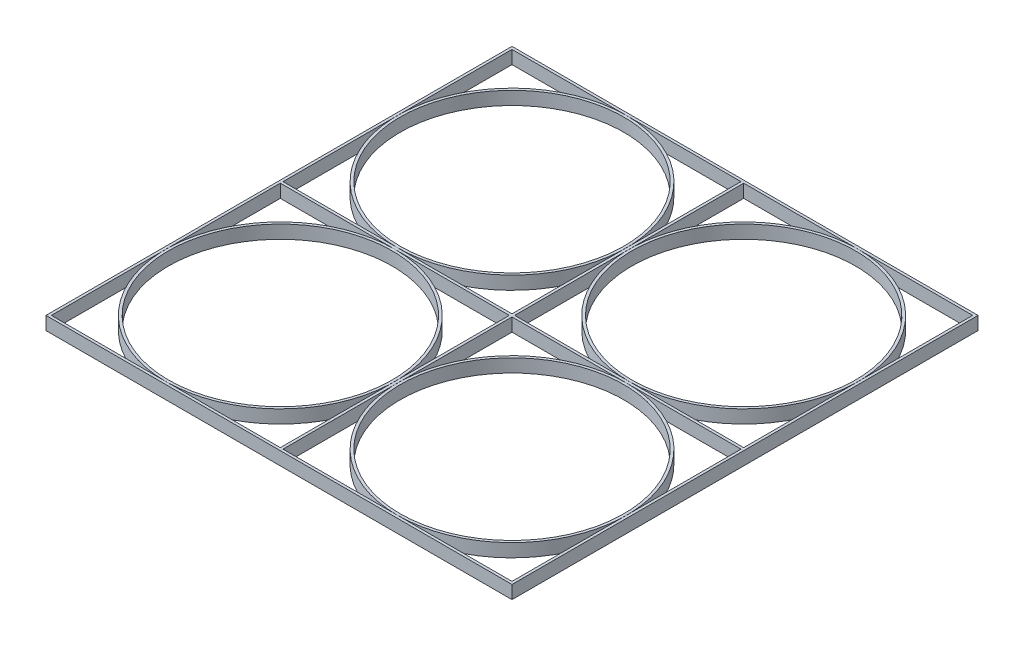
ISO-10303-21;
HEADER;
FILE_DESCRIPTION(('STEP AP214'),'2;1');
FILE_NAME('part.step','',(''),(''),'','','');
FILE_SCHEMA(('AUTOMOTIVE_DESIGN { 1 0 10303 214 1 1 1 1 }'));
ENDSEC;
DATA;
#1=APPLICATION_CONTEXT('core data for automotive mechanical design processes');
#2=APPLICATION_PROTOCOL_DEFINITION('international standard','automotive_design',2000,#1);
#3=PRODUCT_CONTEXT('',#1,'mechanical');
#4=PRODUCT('Part','Part','',(#3));
#5=PRODUCT_RELATED_PRODUCT_CATEGORY('part','',(#4));
#6=PRODUCT_DEFINITION_FORMATION('','',#4);
#7=PRODUCT_DEFINITION_CONTEXT('part definition',#1,'design');
#8=PRODUCT_DEFINITION('design','',#6,#7);
#9=PRODUCT_DEFINITION_SHAPE('','',#8);
#10=(LENGTH_UNIT() NAMED_UNIT(*) SI_UNIT(.MILLI.,.METRE.));
#11=(NAMED_UNIT(*) PLANE_ANGLE_UNIT() SI_UNIT($,.RADIAN.));
#12=(NAMED_UNIT(*) SI_UNIT($,.STERADIAN.) SOLID_ANGLE_UNIT());
#13=UNCERTAINTY_MEASURE_WITH_UNIT(LENGTH_MEASURE(1.E-05),#10,'distance_accuracy_value','');
#14=(GEOMETRIC_REPRESENTATION_CONTEXT(3) GLOBAL_UNCERTAINTY_ASSIGNED_CONTEXT((#13)) GLOBAL_UNIT_ASSIGNED_CONTEXT((#10,
#11,#12)) REPRESENTATION_CONTEXT('',''));
#15=CARTESIAN_POINT('',(0.,0.,0.));
#16=DIRECTION('',(0.,0.,1.));
#17=DIRECTION('',(1.,0.,0.));
#18=AXIS2_PLACEMENT_3D('',#15,#16,#17);
#19=CARTESIAN_POINT('',(87.75,5.,87.75));
#20=DIRECTION('',(0.,1.,0.));
#21=DIRECTION('',(0.,0.,1.));
#22=AXIS2_PLACEMENT_3D('',#19,#20,#21);
#23=PLANE('',#22);
#24=CARTESIAN_POINT('',(87.75,5.,87.75));
#25=DIRECTION('',(0.,1.,0.));
#26=DIRECTION('',(0.,0.,1.));
#27=AXIS2_PLACEMENT_3D('',#24,#25,#26);
#28=CIRCLE('',#27,43.375);
#29=CARTESIAN_POINT('',(87.75,5.,131.125));
#30=VERTEX_POINT('',#29);
#31=EDGE_CURVE('E12',#30,#30,#28,.T.);
#32=ORIENTED_EDGE('',*,*,#31,.T.);
#33=EDGE_LOOP('',(#32));
#34=FACE_BOUND('',#33,.T.);
#35=CARTESIAN_POINT('',(87.75,5.,87.75));
#36=DIRECTION('',(0.,1.,0.));
#37=DIRECTION('',(0.,0.,1.));
#38=AXIS2_PLACEMENT_3D('',#35,#36,#37);
#39=CIRCLE('',#38,42.375);
#40=CARTESIAN_POINT('',(87.75,5.,130.125));
#41=VERTEX_POINT('',#40);
#42=EDGE_CURVE('E79',#41,#41,#39,.T.);
#43=ORIENTED_EDGE('',*,*,#42,.F.);
#44=EDGE_LOOP('',(#43));
#45=FACE_BOUND('',#44,.T.);
#46=ADVANCED_FACE('F68',(#34,#45),#23,.T.);
#47=CARTESIAN_POINT('',(87.75,0.,87.75));
#48=DIRECTION('',(0.,1.,0.));
#49=DIRECTION('',(0.,0.,1.));
#50=AXIS2_PLACEMENT_3D('',#47,#48,#49);
#51=PLANE('',#50);
#52=CARTESIAN_POINT('',(87.75,0.,87.75));
#53=DIRECTION('',(0.,1.,0.));
#54=DIRECTION('',(0.,0.,1.));
#55=AXIS2_PLACEMENT_3D('',#52,#53,#54);
#56=CIRCLE('',#55,43.375);
#57=CARTESIAN_POINT('',(87.75,0.,131.125));
#58=VERTEX_POINT('',#57);
#59=EDGE_CURVE('E72',#58,#58,#56,.T.);
#60=ORIENTED_EDGE('',*,*,#59,.F.);
#61=EDGE_LOOP('',(#60));
#62=FACE_BOUND('',#61,.T.);
#63=CARTESIAN_POINT('',(87.75,0.,87.75));
#64=DIRECTION('',(0.,1.,0.));
#65=DIRECTION('',(0.,0.,1.));
#66=AXIS2_PLACEMENT_3D('',#63,#64,#65);
#67=CIRCLE('',#66,42.375);
#68=CARTESIAN_POINT('',(87.75,0.,130.125));
#69=VERTEX_POINT('',#68);
#70=EDGE_CURVE('E81',#69,#69,#67,.T.);
#71=ORIENTED_EDGE('',*,*,#70,.T.);
#72=EDGE_LOOP('',(#71));
#73=FACE_BOUND('',#72,.T.);
#74=ADVANCED_FACE('F91',(#62,#73),#51,.F.);
#75=CARTESIAN_POINT('',(87.75,5.,87.75));
#76=DIRECTION('',(0.,-1.,0.));
#77=DIRECTION('',(0.,0.,-1.));
#78=AXIS2_PLACEMENT_3D('',#75,#76,#77);
#79=CYLINDRICAL_SURFACE('',#78,43.375);
#80=ORIENTED_EDGE('',*,*,#31,.F.);
#81=EDGE_LOOP('',(#80));
#82=FACE_BOUND('',#81,.T.);
#83=ORIENTED_EDGE('',*,*,#59,.T.);
#84=EDGE_LOOP('',(#83));
#85=FACE_BOUND('',#84,.T.);
#86=ADVANCED_FACE('F70',(#82,#85),#79,.T.);
#87=CARTESIAN_POINT('',(87.75,5.,87.75));
#88=DIRECTION('',(0.,-1.,0.));
#89=DIRECTION('',(0.,0.,-1.));
#90=AXIS2_PLACEMENT_3D('',#87,#88,#89);
#91=CYLINDRICAL_SURFACE('',#90,42.375);
#92=ORIENTED_EDGE('',*,*,#42,.T.);
#93=EDGE_LOOP('',(#92));
#94=FACE_BOUND('',#93,.T.);
#95=ORIENTED_EDGE('',*,*,#70,.F.);
#96=EDGE_LOOP('',(#95));
#97=FACE_BOUND('',#96,.T.);
#98=ADVANCED_FACE('F87',(#94,#97),#91,.F.);
#99=CLOSED_SHELL('',(#46,#74,#86,#98));
#100=MANIFOLD_SOLID_BREP('B2',#99);
#101=CARTESIAN_POINT('',(0.,5.,87.75));
#102=DIRECTION('',(0.,1.,0.));
#103=DIRECTION('',(0.,0.,1.));
#104=AXIS2_PLACEMENT_3D('',#101,#102,#103);
#105=PLANE('',#104);
#106=CARTESIAN_POINT('',(0.,5.,87.75));
#107=DIRECTION('',(0.,1.,0.));
#108=DIRECTION('',(0.,0.,1.));
#109=AXIS2_PLACEMENT_3D('',#106,#107,#108);
#110=CIRCLE('',#109,43.375);
#111=CARTESIAN_POINT('',(0.,5.,131.125));
#112=VERTEX_POINT('',#111);
#113=EDGE_CURVE('E67',#112,#112,#110,.T.);
#114=ORIENTED_EDGE('',*,*,#113,.T.);
#115=EDGE_LOOP('',(#114));
#116=FACE_BOUND('',#115,.T.);
#117=CARTESIAN_POINT('',(0.,5.,87.75));
#118=DIRECTION('',(0.,1.,0.));
#119=DIRECTION('',(0.,0.,1.));
#120=AXIS2_PLACEMENT_3D('',#117,#118,#119);
#121=CIRCLE('',#120,42.375);
#122=CARTESIAN_POINT('',(0.,5.,130.125));
#123=VERTEX_POINT('',#122);
#124=EDGE_CURVE('E149',#123,#123,#121,.T.);
#125=ORIENTED_EDGE('',*,*,#124,.F.);
#126=EDGE_LOOP('',(#125));
#127=FACE_BOUND('',#126,.T.);
#128=ADVANCED_FACE('F138',(#116,#127),#105,.T.);
#129=CARTESIAN_POINT('',(0.,0.,87.75));
#130=DIRECTION('',(0.,1.,0.));
#131=DIRECTION('',(0.,0.,1.));
#132=AXIS2_PLACEMENT_3D('',#129,#130,#131);
#133=PLANE('',#132);
#134=CARTESIAN_POINT('',(0.,0.,87.75));
#135=DIRECTION('',(0.,1.,0.));
#136=DIRECTION('',(0.,0.,1.));
#137=AXIS2_PLACEMENT_3D('',#134,#135,#136);
#138=CIRCLE('',#137,43.375);
#139=CARTESIAN_POINT('',(0.,0.,131.125));
#140=VERTEX_POINT('',#139);
#141=EDGE_CURVE('E142',#140,#140,#138,.T.);
#142=ORIENTED_EDGE('',*,*,#141,.F.);
#143=EDGE_LOOP('',(#142));
#144=FACE_BOUND('',#143,.T.);
#145=CARTESIAN_POINT('',(0.,0.,87.75));
#146=DIRECTION('',(0.,1.,0.));
#147=DIRECTION('',(0.,0.,1.));
#148=AXIS2_PLACEMENT_3D('',#145,#146,#147);
#149=CIRCLE('',#148,42.375);
#150=CARTESIAN_POINT('',(0.,0.,130.125));
#151=VERTEX_POINT('',#150);
#152=EDGE_CURVE('E151',#151,#151,#149,.T.);
#153=ORIENTED_EDGE('',*,*,#152,.T.);
#154=EDGE_LOOP('',(#153));
#155=FACE_BOUND('',#154,.T.);
#156=ADVANCED_FACE('F161',(#144,#155),#133,.F.);
#157=CARTESIAN_POINT('',(0.,5.,87.75));
#158=DIRECTION('',(0.,-1.,0.));
#159=DIRECTION('',(0.,0.,-1.));
#160=AXIS2_PLACEMENT_3D('',#157,#158,#159);
#161=CYLINDRICAL_SURFACE('',#160,43.375);
#162=ORIENTED_EDGE('',*,*,#113,.F.);
#163=EDGE_LOOP('',(#162));
#164=FACE_BOUND('',#163,.T.);
#165=ORIENTED_EDGE('',*,*,#141,.T.);
#166=EDGE_LOOP('',(#165));
#167=FACE_BOUND('',#166,.T.);
#168=ADVANCED_FACE('F140',(#164,#167),#161,.T.);
#169=CARTESIAN_POINT('',(0.,5.,87.75));
#170=DIRECTION('',(0.,-1.,0.));
#171=DIRECTION('',(0.,0.,-1.));
#172=AXIS2_PLACEMENT_3D('',#169,#170,#171);
#173=CYLINDRICAL_SURFACE('',#172,42.375);
#174=ORIENTED_EDGE('',*,*,#124,.T.);
#175=EDGE_LOOP('',(#174));
#176=FACE_BOUND('',#175,.T.);
#177=ORIENTED_EDGE('',*,*,#152,.F.);
#178=EDGE_LOOP('',(#177));
#179=FACE_BOUND('',#178,.T.);
#180=ADVANCED_FACE('F157',(#176,#179),#173,.F.);
#181=CLOSED_SHELL('',(#128,#156,#168,#180));
#182=MANIFOLD_SOLID_BREP('B7',#181);
#183=CARTESIAN_POINT('',(87.75,5.,0.));
#184=DIRECTION('',(0.,1.,0.));
#185=DIRECTION('',(0.,0.,1.));
#186=AXIS2_PLACEMENT_3D('',#183,#184,#185);
#187=PLANE('',#186);
#188=CARTESIAN_POINT('',(87.75,5.,0.));
#189=DIRECTION('',(0.,1.,0.));
#190=DIRECTION('',(0.,0.,1.));
#191=AXIS2_PLACEMENT_3D('',#188,#189,#190);
#192=CIRCLE('',#191,43.375);
#193=CARTESIAN_POINT('',(87.75,5.,43.375));
#194=VERTEX_POINT('',#193);
#195=EDGE_CURVE('E137',#194,#194,#192,.T.);
#196=ORIENTED_EDGE('',*,*,#195,.T.);
#197=EDGE_LOOP('',(#196));
#198=FACE_BOUND('',#197,.T.);
#199=CARTESIAN_POINT('',(87.75,5.,0.));
#200=DIRECTION('',(0.,1.,0.));
#201=DIRECTION('',(0.,0.,1.));
#202=AXIS2_PLACEMENT_3D('',#199,#200,#201);
#203=CIRCLE('',#202,42.375);
#204=CARTESIAN_POINT('',(87.75,5.,42.375));
#205=VERTEX_POINT('',#204);
#206=EDGE_CURVE('E219',#205,#205,#203,.T.);
#207=ORIENTED_EDGE('',*,*,#206,.F.);
#208=EDGE_LOOP('',(#207));
#209=FACE_BOUND('',#208,.T.);
#210=ADVANCED_FACE('F208',(#198,#209),#187,.T.);
#211=CARTESIAN_POINT('',(87.75,0.,0.));
#212=DIRECTION('',(0.,1.,0.));
#213=DIRECTION('',(0.,0.,1.));
#214=AXIS2_PLACEMENT_3D('',#211,#212,#213);
#215=PLANE('',#214);
#216=CARTESIAN_POINT('',(87.75,0.,0.));
#217=DIRECTION('',(0.,1.,0.));
#218=DIRECTION('',(0.,0.,1.));
#219=AXIS2_PLACEMENT_3D('',#216,#217,#218);
#220=CIRCLE('',#219,43.375);
#221=CARTESIAN_POINT('',(87.75,0.,43.375));
#222=VERTEX_POINT('',#221);
#223=EDGE_CURVE('E212',#222,#222,#220,.T.);
#224=ORIENTED_EDGE('',*,*,#223,.F.);
#225=EDGE_LOOP('',(#224));
#226=FACE_BOUND('',#225,.T.);
#227=CARTESIAN_POINT('',(87.75,0.,0.));
#228=DIRECTION('',(0.,1.,0.));
#229=DIRECTION('',(0.,0.,1.));
#230=AXIS2_PLACEMENT_3D('',#227,#228,#229);
#231=CIRCLE('',#230,42.375);
#232=CARTESIAN_POINT('',(87.75,0.,42.375));
#233=VERTEX_POINT('',#232);
#234=EDGE_CURVE('E221',#233,#233,#231,.T.);
#235=ORIENTED_EDGE('',*,*,#234,.T.);
#236=EDGE_LOOP('',(#235));
#237=FACE_BOUND('',#236,.T.);
#238=ADVANCED_FACE('F231',(#226,#237),#215,.F.);
#239=CARTESIAN_POINT('',(87.75,5.,0.));
#240=DIRECTION('',(0.,-1.,0.));
#241=DIRECTION('',(0.,0.,-1.));
#242=AXIS2_PLACEMENT_3D('',#239,#240,#241);
#243=CYLINDRICAL_SURFACE('',#242,43.375);
#244=ORIENTED_EDGE('',*,*,#195,.F.);
#245=EDGE_LOOP('',(#244));
#246=FACE_BOUND('',#245,.T.);
#247=ORIENTED_EDGE('',*,*,#223,.T.);
#248=EDGE_LOOP('',(#247));
#249=FACE_BOUND('',#248,.T.);
#250=ADVANCED_FACE('F210',(#246,#249),#243,.T.);
#251=CARTESIAN_POINT('',(87.75,5.,0.));
#252=DIRECTION('',(0.,-1.,0.));
#253=DIRECTION('',(0.,0.,-1.));
#254=AXIS2_PLACEMENT_3D('',#251,#252,#253);
#255=CYLINDRICAL_SURFACE('',#254,42.375);
#256=ORIENTED_EDGE('',*,*,#206,.T.);
#257=EDGE_LOOP('',(#256));
#258=FACE_BOUND('',#257,.T.);
#259=ORIENTED_EDGE('',*,*,#234,.F.);
#260=EDGE_LOOP('',(#259));
#261=FACE_BOUND('',#260,.T.);
#262=ADVANCED_FACE('F227',(#258,#261),#255,.F.);
#263=CLOSED_SHELL('',(#210,#238,#250,#262));
#264=MANIFOLD_SOLID_BREP('B62',#263);
#265=CARTESIAN_POINT('',(0.,5.,0.));
#266=DIRECTION('',(0.,1.,0.));
#267=DIRECTION('',(0.,0.,1.));
#268=AXIS2_PLACEMENT_3D('',#265,#266,#267);
#269=PLANE('',#268);
#270=CARTESIAN_POINT('',(0.,5.,0.));
#271=DIRECTION('',(0.,1.,0.));
#272=DIRECTION('',(0.,0.,1.));
#273=AXIS2_PLACEMENT_3D('',#270,#271,#272);
#274=CIRCLE('',#273,43.375);
#275=CARTESIAN_POINT('',(0.,5.,43.375));
#276=VERTEX_POINT('',#275);
#277=EDGE_CURVE('E207',#276,#276,#274,.T.);
#278=ORIENTED_EDGE('',*,*,#277,.T.);
#279=EDGE_LOOP('',(#278));
#280=FACE_BOUND('',#279,.T.);
#281=CARTESIAN_POINT('',(0.,5.,0.));
#282=DIRECTION('',(0.,1.,0.));
#283=DIRECTION('',(0.,0.,1.));
#284=AXIS2_PLACEMENT_3D('',#281,#282,#283);
#285=CIRCLE('',#284,42.375);
#286=CARTESIAN_POINT('',(0.,5.,42.375));
#287=VERTEX_POINT('',#286);
#288=EDGE_CURVE('E290',#287,#287,#285,.T.);
#289=ORIENTED_EDGE('',*,*,#288,.F.);
#290=EDGE_LOOP('',(#289));
#291=FACE_BOUND('',#290,.T.);
#292=ADVANCED_FACE('F279',(#280,#291),#269,.T.);
#293=CARTESIAN_POINT('',(0.,0.,0.));
#294=DIRECTION('',(0.,1.,0.));
#295=DIRECTION('',(0.,0.,1.));
#296=AXIS2_PLACEMENT_3D('',#293,#294,#295);
#297=PLANE('',#296);
#298=CARTESIAN_POINT('',(0.,0.,0.));
#299=DIRECTION('',(0.,1.,0.));
#300=DIRECTION('',(0.,0.,1.));
#301=AXIS2_PLACEMENT_3D('',#298,#299,#300);
#302=CIRCLE('',#301,43.375);
#303=CARTESIAN_POINT('',(0.,0.,43.375));
#304=VERTEX_POINT('',#303);
#305=EDGE_CURVE('E283',#304,#304,#302,.T.);
#306=ORIENTED_EDGE('',*,*,#305,.F.);
#307=EDGE_LOOP('',(#306));
#308=FACE_BOUND('',#307,.T.);
#309=CARTESIAN_POINT('',(0.,0.,0.));
#310=DIRECTION('',(0.,1.,0.));
#311=DIRECTION('',(0.,0.,1.));
#312=AXIS2_PLACEMENT_3D('',#309,#310,#311);
#313=CIRCLE('',#312,42.375);
#314=CARTESIAN_POINT('',(0.,0.,42.375));
#315=VERTEX_POINT('',#314);
#316=EDGE_CURVE('E292',#315,#315,#313,.T.);
#317=ORIENTED_EDGE('',*,*,#316,.T.);
#318=EDGE_LOOP('',(#317));
#319=FACE_BOUND('',#318,.T.);
#320=ADVANCED_FACE('F302',(#308,#319),#297,.F.);
#321=CARTESIAN_POINT('',(0.,5.,0.));
#322=DIRECTION('',(0.,-1.,0.));
#323=DIRECTION('',(0.,0.,-1.));
#324=AXIS2_PLACEMENT_3D('',#321,#322,#323);
#325=CYLINDRICAL_SURFACE('',#324,43.375);
#326=ORIENTED_EDGE('',*,*,#277,.F.);
#327=EDGE_LOOP('',(#326));
#328=FACE_BOUND('',#327,.T.);
#329=ORIENTED_EDGE('',*,*,#305,.T.);
#330=EDGE_LOOP('',(#329));
#331=FACE_BOUND('',#330,.T.);
#332=ADVANCED_FACE('F281',(#328,#331),#325,.T.);
#333=CARTESIAN_POINT('',(0.,5.,0.));
#334=DIRECTION('',(0.,-1.,0.));
#335=DIRECTION('',(0.,0.,-1.));
#336=AXIS2_PLACEMENT_3D('',#333,#334,#335);
#337=CYLINDRICAL_SURFACE('',#336,42.375);
#338=ORIENTED_EDGE('',*,*,#288,.T.);
#339=EDGE_LOOP('',(#338));
#340=FACE_BOUND('',#339,.T.);
#341=ORIENTED_EDGE('',*,*,#316,.F.);
#342=EDGE_LOOP('',(#341));
#343=FACE_BOUND('',#342,.T.);
#344=ADVANCED_FACE('F298',(#340,#343),#337,.F.);
#345=CLOSED_SHELL('',(#292,#320,#332,#344));
#346=MANIFOLD_SOLID_BREP('B132',#345);
#347=CARTESIAN_POINT('',(0.,5.,0.));
#348=DIRECTION('',(0.,1.,0.));
#349=DIRECTION('',(0.,0.,1.));
#350=AXIS2_PLACEMENT_3D('',#347,#348,#349);
#351=PLANE('',#350);
#352=DIRECTION('',(-1.,0.,0.));
#353=VECTOR('',#352,1.);
#354=CARTESIAN_POINT('',(-43.375,5.,-43.375));
#355=LINE('',#354,#353);
#356=CARTESIAN_POINT('',(43.375,5.,-43.375));
#357=VERTEX_POINT('',#356);
#358=CARTESIAN_POINT('',(-43.375,5.,-43.375));
#359=VERTEX_POINT('',#358);
#360=EDGE_CURVE('E614',#357,#359,#355,.T.);
#361=ORIENTED_EDGE('',*,*,#360,.F.);
#362=DIRECTION('',(0.,0.,-1.));
#363=VECTOR('',#362,1.);
#364=CARTESIAN_POINT('',(43.375,5.,-43.375));
#365=LINE('',#364,#363);
#366=CARTESIAN_POINT('',(43.375,5.,43.375));
#367=VERTEX_POINT('',#366);
#368=EDGE_CURVE('E612',#367,#357,#365,.T.);
#369=ORIENTED_EDGE('',*,*,#368,.F.);
#370=DIRECTION('',(1.,0.,0.));
#371=VECTOR('',#370,1.);
#372=CARTESIAN_POINT('',(-43.375,5.,43.375));
#373=LINE('',#372,#371);
#374=CARTESIAN_POINT('',(-43.375,5.,43.375));
#375=VERTEX_POINT('',#374);
#376=EDGE_CURVE('E619',#375,#367,#373,.T.);
#377=ORIENTED_EDGE('',*,*,#376,.F.);
#378=DIRECTION('',(0.,0.,1.));
#379=VECTOR('',#378,1.);
#380=CARTESIAN_POINT('',(-43.375,5.,-43.375));
#381=LINE('',#380,#379);
#382=EDGE_CURVE('E617',#359,#375,#381,.T.);
#383=ORIENTED_EDGE('',*,*,#382,.F.);
#384=EDGE_LOOP('',(#361,#369,#377,#383));
#385=FACE_BOUND('',#384,.T.);
#386=DIRECTION('',(0.,0.,1.));
#387=VECTOR('',#386,1.);
#388=CARTESIAN_POINT('',(-44.3749999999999,5.,-43.875));
#389=LINE('',#388,#387);
#390=CARTESIAN_POINT('',(-44.3749999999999,5.,-44.375));
#391=VERTEX_POINT('',#390);
#392=CARTESIAN_POINT('',(-44.3749999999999,5.,132.125));
#393=VERTEX_POINT('',#392);
#394=EDGE_CURVE('E583',#391,#393,#389,.T.);
#395=ORIENTED_EDGE('',*,*,#394,.T.);
#396=DIRECTION('',(1.,0.,0.));
#397=VECTOR('',#396,1.);
#398=CARTESIAN_POINT('',(-43.8749999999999,5.,132.125));
#399=LINE('',#398,#397);
#400=CARTESIAN_POINT('',(132.125,5.,132.125));
#401=VERTEX_POINT('',#400);
#402=EDGE_CURVE('E586',#393,#401,#399,.T.);
#403=ORIENTED_EDGE('',*,*,#402,.T.);
#404=DIRECTION('',(0.,0.,-1.));
#405=VECTOR('',#404,1.);
#406=CARTESIAN_POINT('',(132.125,5.,-43.875));
#407=LINE('',#406,#405);
#408=CARTESIAN_POINT('',(132.125,5.,-44.375));
#409=VERTEX_POINT('',#408);
#410=EDGE_CURVE('E589',#401,#409,#407,.T.);
#411=ORIENTED_EDGE('',*,*,#410,.T.);
#412=DIRECTION('',(-1.,0.,0.));
#413=VECTOR('',#412,1.);
#414=CARTESIAN_POINT('',(-43.8749999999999,5.,-44.375));
#415=LINE('',#414,#413);
#416=EDGE_CURVE('E591',#409,#391,#415,.T.);
#417=ORIENTED_EDGE('',*,*,#416,.T.);
#418=EDGE_LOOP('',(#395,#403,#411,#417));
#419=FACE_BOUND('',#418,.T.);
#420=DIRECTION('',(-1.,0.,0.));
#421=VECTOR('',#420,1.);
#422=CARTESIAN_POINT('',(44.375,5.,-43.375));
#423=LINE('',#422,#421);
#424=CARTESIAN_POINT('',(131.125,5.,-43.375));
#425=VERTEX_POINT('',#424);
#426=CARTESIAN_POINT('',(44.375,5.,-43.375));
#427=VERTEX_POINT('',#426);
#428=EDGE_CURVE('E554',#425,#427,#423,.T.);
#429=ORIENTED_EDGE('',*,*,#428,.F.);
#430=DIRECTION('',(0.,0.,-1.));
#431=VECTOR('',#430,1.);
#432=CARTESIAN_POINT('',(131.125,5.,-43.375));
#433=LINE('',#432,#431);
#434=CARTESIAN_POINT('',(131.125,5.,43.375));
#435=VERTEX_POINT('',#434);
#436=EDGE_CURVE('E552',#435,#425,#433,.T.);
#437=ORIENTED_EDGE('',*,*,#436,.F.);
#438=DIRECTION('',(1.,0.,0.));
#439=VECTOR('',#438,1.);
#440=CARTESIAN_POINT('',(44.375,5.,43.375));
#441=LINE('',#440,#439);
#442=CARTESIAN_POINT('',(44.375,5.,43.375));
#443=VERTEX_POINT('',#442);
#444=EDGE_CURVE('E560',#443,#435,#441,.T.);
#445=ORIENTED_EDGE('',*,*,#444,.F.);
#446=DIRECTION('',(0.,0.,1.));
#447=VECTOR('',#446,1.);
#448=CARTESIAN_POINT('',(44.375,5.,-43.375));
#449=LINE('',#448,#447);
#450=EDGE_CURVE('E557',#427,#443,#449,.T.);
#451=ORIENTED_EDGE('',*,*,#450,.F.);
#452=EDGE_LOOP('',(#429,#437,#445,#451));
#453=FACE_BOUND('',#452,.T.);
#454=DIRECTION('',(-1.,0.,0.));
#455=VECTOR('',#454,1.);
#456=CARTESIAN_POINT('',(-43.375,5.,44.375));
#457=LINE('',#456,#455);
#458=CARTESIAN_POINT('',(43.375,5.,44.375));
#459=VERTEX_POINT('',#458);
#460=CARTESIAN_POINT('',(-43.375,5.,44.375));
#461=VERTEX_POINT('',#460);
#462=EDGE_CURVE('E523',#459,#461,#457,.T.);
#463=ORIENTED_EDGE('',*,*,#462,.F.);
#464=DIRECTION('',(0.,0.,-1.));
#465=VECTOR('',#464,1.);
#466=CARTESIAN_POINT('',(43.375,5.,44.375));
#467=LINE('',#466,#465);
#468=CARTESIAN_POINT('',(43.375,5.,131.125));
#469=VERTEX_POINT('',#468);
#470=EDGE_CURVE('E521',#469,#459,#467,.T.);
#471=ORIENTED_EDGE('',*,*,#470,.F.);
#472=DIRECTION('',(1.,0.,0.));
#473=VECTOR('',#472,1.);
#474=CARTESIAN_POINT('',(-43.375,5.,131.125));
#475=LINE('',#474,#473);
#476=CARTESIAN_POINT('',(-43.375,5.,131.125));
#477=VERTEX_POINT('',#476);
#478=EDGE_CURVE('E529',#477,#469,#475,.T.);
#479=ORIENTED_EDGE('',*,*,#478,.F.);
#480=DIRECTION('',(0.,0.,1.));
#481=VECTOR('',#480,1.);
#482=CARTESIAN_POINT('',(-43.375,5.,44.375));
#483=LINE('',#482,#481);
#484=EDGE_CURVE('E526',#461,#477,#483,.T.);
#485=ORIENTED_EDGE('',*,*,#484,.F.);
#486=EDGE_LOOP('',(#463,#471,#479,#485));
#487=FACE_BOUND('',#486,.T.);
#488=DIRECTION('',(-1.,0.,0.));
#489=VECTOR('',#488,1.);
#490=CARTESIAN_POINT('',(44.375,5.,44.375));
#491=LINE('',#490,#489);
#492=CARTESIAN_POINT('',(131.125,5.,44.375));
#493=VERTEX_POINT('',#492);
#494=CARTESIAN_POINT('',(44.375,5.,44.375));
#495=VERTEX_POINT('',#494);
#496=EDGE_CURVE('E490',#493,#495,#491,.T.);
#497=ORIENTED_EDGE('',*,*,#496,.F.);
#498=DIRECTION('',(0.,0.,-1.));
#499=VECTOR('',#498,1.);
#500=CARTESIAN_POINT('',(131.125,5.,44.375));
#501=LINE('',#500,#499);
#502=CARTESIAN_POINT('',(131.125,5.,131.125));
#503=VERTEX_POINT('',#502);
#504=EDGE_CURVE('E480',#503,#493,#501,.T.);
#505=ORIENTED_EDGE('',*,*,#504,.F.);
#506=DIRECTION('',(1.,0.,0.));
#507=VECTOR('',#506,1.);
#508=CARTESIAN_POINT('',(44.375,5.,131.125));
#509=LINE('',#508,#507);
#510=CARTESIAN_POINT('',(44.375,5.,131.125));
#511=VERTEX_POINT('',#510);
#512=EDGE_CURVE('E505',#511,#503,#509,.T.);
#513=ORIENTED_EDGE('',*,*,#512,.F.);
#514=DIRECTION('',(0.,0.,1.));
#515=VECTOR('',#514,1.);
#516=CARTESIAN_POINT('',(44.375,5.,44.375));
#517=LINE('',#516,#515);
#518=EDGE_CURVE('E503',#495,#511,#517,.T.);
#519=ORIENTED_EDGE('',*,*,#518,.F.);
#520=EDGE_LOOP('',(#497,#505,#513,#519));
#521=FACE_BOUND('',#520,.T.);
#522=ADVANCED_FACE('F341',(#385,#419,#453,#487,#521),#351,.T.);
#523=CARTESIAN_POINT('',(0.,0.,0.));
#524=DIRECTION('',(0.,1.,0.));
#525=DIRECTION('',(0.,0.,1.));
#526=AXIS2_PLACEMENT_3D('',#523,#524,#525);
#527=PLANE('',#526);
#528=DIRECTION('',(0.,0.,-1.));
#529=VECTOR('',#528,1.);
#530=CARTESIAN_POINT('',(43.375,0.,-43.375));
#531=LINE('',#530,#529);
#532=CARTESIAN_POINT('',(43.375,0.,43.375));
#533=VERTEX_POINT('',#532);
#534=CARTESIAN_POINT('',(43.375,0.,-43.375));
#535=VERTEX_POINT('',#534);
#536=EDGE_CURVE('E363',#533,#535,#531,.T.);
#537=ORIENTED_EDGE('',*,*,#536,.T.);
#538=DIRECTION('',(-1.,0.,0.));
#539=VECTOR('',#538,1.);
#540=CARTESIAN_POINT('',(-43.375,0.,-43.375));
#541=LINE('',#540,#539);
#542=CARTESIAN_POINT('',(-43.375,0.,-43.375));
#543=VERTEX_POINT('',#542);
#544=EDGE_CURVE('E623',#535,#543,#541,.T.);
#545=ORIENTED_EDGE('',*,*,#544,.T.);
#546=DIRECTION('',(0.,0.,1.));
#547=VECTOR('',#546,1.);
#548=CARTESIAN_POINT('',(-43.375,0.,-43.375));
#549=LINE('',#548,#547);
#550=CARTESIAN_POINT('',(-43.375,0.,43.375));
#551=VERTEX_POINT('',#550);
#552=EDGE_CURVE('E626',#543,#551,#549,.T.);
#553=ORIENTED_EDGE('',*,*,#552,.T.);
#554=DIRECTION('',(1.,0.,0.));
#555=VECTOR('',#554,1.);
#556=CARTESIAN_POINT('',(-43.375,0.,43.375));
#557=LINE('',#556,#555);
#558=EDGE_CURVE('E615',#551,#533,#557,.T.);
#559=ORIENTED_EDGE('',*,*,#558,.T.);
#560=EDGE_LOOP('',(#537,#545,#553,#559));
#561=FACE_BOUND('',#560,.T.);
#562=DIRECTION('',(0.,0.,1.));
#563=VECTOR('',#562,1.);
#564=CARTESIAN_POINT('',(-44.3749999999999,0.,-43.875));
#565=LINE('',#564,#563);
#566=CARTESIAN_POINT('',(-44.3749999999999,0.,-44.375));
#567=VERTEX_POINT('',#566);
#568=CARTESIAN_POINT('',(-44.3749999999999,0.,132.125));
#569=VERTEX_POINT('',#568);
#570=EDGE_CURVE('E582',#567,#569,#565,.T.);
#571=ORIENTED_EDGE('',*,*,#570,.F.);
#572=DIRECTION('',(-1.,0.,0.));
#573=VECTOR('',#572,1.);
#574=CARTESIAN_POINT('',(-43.8749999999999,0.,-44.375));
#575=LINE('',#574,#573);
#576=CARTESIAN_POINT('',(132.125,0.,-44.375));
#577=VERTEX_POINT('',#576);
#578=EDGE_CURVE('E587',#577,#567,#575,.T.);
#579=ORIENTED_EDGE('',*,*,#578,.F.);
#580=DIRECTION('',(0.,0.,-1.));
#581=VECTOR('',#580,1.);
#582=CARTESIAN_POINT('',(132.125,0.,-43.875));
#583=LINE('',#582,#581);
#584=CARTESIAN_POINT('',(132.125,0.,132.125));
#585=VERTEX_POINT('',#584);
#586=EDGE_CURVE('E598',#585,#577,#583,.T.);
#587=ORIENTED_EDGE('',*,*,#586,.F.);
#588=DIRECTION('',(1.,0.,0.));
#589=VECTOR('',#588,1.);
#590=CARTESIAN_POINT('',(-43.8749999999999,0.,132.125));
#591=LINE('',#590,#589);
#592=EDGE_CURVE('E596',#569,#585,#591,.T.);
#593=ORIENTED_EDGE('',*,*,#592,.F.);
#594=EDGE_LOOP('',(#571,#579,#587,#593));
#595=FACE_BOUND('',#594,.T.);
#596=DIRECTION('',(0.,0.,-1.));
#597=VECTOR('',#596,1.);
#598=CARTESIAN_POINT('',(131.125,0.,-43.375));
#599=LINE('',#598,#597);
#600=CARTESIAN_POINT('',(131.125,0.,43.375));
#601=VERTEX_POINT('',#600);
#602=CARTESIAN_POINT('',(131.125,0.,-43.375));
#603=VERTEX_POINT('',#602);
#604=EDGE_CURVE('E551',#601,#603,#599,.T.);
#605=ORIENTED_EDGE('',*,*,#604,.T.);
#606=DIRECTION('',(-1.,0.,0.));
#607=VECTOR('',#606,1.);
#608=CARTESIAN_POINT('',(44.375,0.,-43.375));
#609=LINE('',#608,#607);
#610=CARTESIAN_POINT('',(44.375,0.,-43.375));
#611=VERTEX_POINT('',#610);
#612=EDGE_CURVE('E565',#603,#611,#609,.T.);
#613=ORIENTED_EDGE('',*,*,#612,.T.);
#614=DIRECTION('',(0.,0.,1.));
#615=VECTOR('',#614,1.);
#616=CARTESIAN_POINT('',(44.375,0.,-43.375));
#617=LINE('',#616,#615);
#618=CARTESIAN_POINT('',(44.375,0.,43.375));
#619=VERTEX_POINT('',#618);
#620=EDGE_CURVE('E568',#611,#619,#617,.T.);
#621=ORIENTED_EDGE('',*,*,#620,.T.);
#622=DIRECTION('',(1.,0.,0.));
#623=VECTOR('',#622,1.);
#624=CARTESIAN_POINT('',(44.375,0.,43.375));
#625=LINE('',#624,#623);
#626=EDGE_CURVE('E555',#619,#601,#625,.T.);
#627=ORIENTED_EDGE('',*,*,#626,.T.);
#628=EDGE_LOOP('',(#605,#613,#621,#627));
#629=FACE_BOUND('',#628,.T.);
#630=DIRECTION('',(0.,0.,-1.));
#631=VECTOR('',#630,1.);
#632=CARTESIAN_POINT('',(43.375,0.,44.375));
#633=LINE('',#632,#631);
#634=CARTESIAN_POINT('',(43.375,0.,131.125));
#635=VERTEX_POINT('',#634);
#636=CARTESIAN_POINT('',(43.375,0.,44.375));
#637=VERTEX_POINT('',#636);
#638=EDGE_CURVE('E498',#635,#637,#633,.T.);
#639=ORIENTED_EDGE('',*,*,#638,.T.);
#640=DIRECTION('',(-1.,0.,0.));
#641=VECTOR('',#640,1.);
#642=CARTESIAN_POINT('',(-43.375,0.,44.375));
#643=LINE('',#642,#641);
#644=CARTESIAN_POINT('',(-43.375,0.,44.375));
#645=VERTEX_POINT('',#644);
#646=EDGE_CURVE('E534',#637,#645,#643,.T.);
#647=ORIENTED_EDGE('',*,*,#646,.T.);
#648=DIRECTION('',(0.,0.,1.));
#649=VECTOR('',#648,1.);
#650=CARTESIAN_POINT('',(-43.375,0.,44.375));
#651=LINE('',#650,#649);
#652=CARTESIAN_POINT('',(-43.375,0.,131.125));
#653=VERTEX_POINT('',#652);
#654=EDGE_CURVE('E537',#645,#653,#651,.T.);
#655=ORIENTED_EDGE('',*,*,#654,.T.);
#656=DIRECTION('',(1.,0.,0.));
#657=VECTOR('',#656,1.);
#658=CARTESIAN_POINT('',(-43.375,0.,131.125));
#659=LINE('',#658,#657);
#660=EDGE_CURVE('E524',#653,#635,#659,.T.);
#661=ORIENTED_EDGE('',*,*,#660,.T.);
#662=EDGE_LOOP('',(#639,#647,#655,#661));
#663=FACE_BOUND('',#662,.T.);
#664=DIRECTION('',(0.,0.,-1.));
#665=VECTOR('',#664,1.);
#666=CARTESIAN_POINT('',(131.125,0.,44.375));
#667=LINE('',#666,#665);
#668=CARTESIAN_POINT('',(131.125,0.,131.125));
#669=VERTEX_POINT('',#668);
#670=CARTESIAN_POINT('',(131.125,0.,44.375));
#671=VERTEX_POINT('',#670);
#672=EDGE_CURVE('E509',#669,#671,#667,.T.);
#673=ORIENTED_EDGE('',*,*,#672,.T.);
#674=DIRECTION('',(-1.,0.,0.));
#675=VECTOR('',#674,1.);
#676=CARTESIAN_POINT('',(44.375,0.,44.375));
#677=LINE('',#676,#675);
#678=CARTESIAN_POINT('',(44.375,0.,44.375));
#679=VERTEX_POINT('',#678);
#680=EDGE_CURVE('E497',#671,#679,#677,.T.);
#681=ORIENTED_EDGE('',*,*,#680,.T.);
#682=DIRECTION('',(0.,0.,1.));
#683=VECTOR('',#682,1.);
#684=CARTESIAN_POINT('',(44.375,0.,44.375));
#685=LINE('',#684,#683);
#686=CARTESIAN_POINT('',(44.375,0.,131.125));
#687=VERTEX_POINT('',#686);
#688=EDGE_CURVE('E512',#679,#687,#685,.T.);
#689=ORIENTED_EDGE('',*,*,#688,.T.);
#690=DIRECTION('',(1.,0.,0.));
#691=VECTOR('',#690,1.);
#692=CARTESIAN_POINT('',(44.375,0.,131.125));
#693=LINE('',#692,#691);
#694=EDGE_CURVE('E491',#687,#669,#693,.T.);
#695=ORIENTED_EDGE('',*,*,#694,.T.);
#696=EDGE_LOOP('',(#673,#681,#689,#695));
#697=FACE_BOUND('',#696,.T.);
#698=ADVANCED_FACE('F343',(#561,#595,#629,#663,#697),#527,.F.);
#699=CARTESIAN_POINT('',(43.375,5.,-43.375));
#700=DIRECTION('',(-1.,0.,0.));
#701=DIRECTION('',(0.,0.,1.));
#702=AXIS2_PLACEMENT_3D('',#699,#700,#701);
#703=PLANE('',#702);
#704=ORIENTED_EDGE('',*,*,#536,.F.);
#705=DIRECTION('',(0.,-1.,0.));
#706=VECTOR('',#705,1.);
#707=CARTESIAN_POINT('',(43.375,5.,43.375));
#708=LINE('',#707,#706);
#709=EDGE_CURVE('E621',#367,#533,#708,.T.);
#710=ORIENTED_EDGE('',*,*,#709,.F.);
#711=ORIENTED_EDGE('',*,*,#368,.T.);
#712=DIRECTION('',(0.,-1.,0.));
#713=VECTOR('',#712,1.);
#714=CARTESIAN_POINT('',(43.375,5.,-43.375));
#715=LINE('',#714,#713);
#716=EDGE_CURVE('E277',#357,#535,#715,.T.);
#717=ORIENTED_EDGE('',*,*,#716,.T.);
#718=EDGE_LOOP('',(#704,#710,#711,#717));
#719=FACE_BOUND('',#718,.T.);
#720=ADVANCED_FACE('F646',(#719),#703,.T.);
#721=CARTESIAN_POINT('',(-43.375,5.,-43.375));
#722=DIRECTION('',(0.,0.,1.));
#723=DIRECTION('',(1.,0.,0.));
#724=AXIS2_PLACEMENT_3D('',#721,#722,#723);
#725=PLANE('',#724);
#726=ORIENTED_EDGE('',*,*,#544,.F.);
#727=ORIENTED_EDGE('',*,*,#716,.F.);
#728=ORIENTED_EDGE('',*,*,#360,.T.);
#729=DIRECTION('',(0.,-1.,0.));
#730=VECTOR('',#729,1.);
#731=CARTESIAN_POINT('',(-43.375,5.,-43.375));
#732=LINE('',#731,#730);
#733=EDGE_CURVE('E349',#359,#543,#732,.T.);
#734=ORIENTED_EDGE('',*,*,#733,.T.);
#735=EDGE_LOOP('',(#726,#727,#728,#734));
#736=FACE_BOUND('',#735,.T.);
#737=ADVANCED_FACE('F635',(#736),#725,.T.);
#738=CARTESIAN_POINT('',(-43.375,5.,-43.375));
#739=DIRECTION('',(1.,0.,0.));
#740=DIRECTION('',(0.,0.,-1.));
#741=AXIS2_PLACEMENT_3D('',#738,#739,#740);
#742=PLANE('',#741);
#743=ORIENTED_EDGE('',*,*,#552,.F.);
#744=ORIENTED_EDGE('',*,*,#733,.F.);
#745=ORIENTED_EDGE('',*,*,#382,.T.);
#746=DIRECTION('',(0.,-1.,0.));
#747=VECTOR('',#746,1.);
#748=CARTESIAN_POINT('',(-43.375,5.,43.375));
#749=LINE('',#748,#747);
#750=EDGE_CURVE('E356',#375,#551,#749,.T.);
#751=ORIENTED_EDGE('',*,*,#750,.T.);
#752=EDGE_LOOP('',(#743,#744,#745,#751));
#753=FACE_BOUND('',#752,.T.);
#754=ADVANCED_FACE('F640',(#753),#742,.T.);
#755=CARTESIAN_POINT('',(-43.375,5.,43.375));
#756=DIRECTION('',(0.,0.,-1.));
#757=DIRECTION('',(-1.,0.,0.));
#758=AXIS2_PLACEMENT_3D('',#755,#756,#757);
#759=PLANE('',#758);
#760=ORIENTED_EDGE('',*,*,#558,.F.);
#761=ORIENTED_EDGE('',*,*,#750,.F.);
#762=ORIENTED_EDGE('',*,*,#376,.T.);
#763=ORIENTED_EDGE('',*,*,#709,.T.);
#764=EDGE_LOOP('',(#760,#761,#762,#763));
#765=FACE_BOUND('',#764,.T.);
#766=ADVANCED_FACE('F643',(#765),#759,.T.);
#767=CARTESIAN_POINT('',(-44.3749999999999,5.,-43.875));
#768=DIRECTION('',(1.,0.,0.));
#769=DIRECTION('',(0.,0.,-1.));
#770=AXIS2_PLACEMENT_3D('',#767,#768,#769);
#771=PLANE('',#770);
#772=ORIENTED_EDGE('',*,*,#570,.T.);
#773=DIRECTION('',(0.,-1.,0.));
#774=VECTOR('',#773,1.);
#775=CARTESIAN_POINT('',(-44.3749999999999,5.,132.125));
#776=LINE('',#775,#774);
#777=EDGE_CURVE('E609',#393,#569,#776,.T.);
#778=ORIENTED_EDGE('',*,*,#777,.F.);
#779=ORIENTED_EDGE('',*,*,#394,.F.);
#780=DIRECTION('',(0.,-1.,0.));
#781=VECTOR('',#780,1.);
#782=CARTESIAN_POINT('',(-44.3749999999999,5.,-44.375));
#783=LINE('',#782,#781);
#784=EDGE_CURVE('E593',#391,#567,#783,.T.);
#785=ORIENTED_EDGE('',*,*,#784,.T.);
#786=EDGE_LOOP('',(#772,#778,#779,#785));
#787=FACE_BOUND('',#786,.T.);
#788=ADVANCED_FACE('F717',(#787),#771,.F.);
#789=CARTESIAN_POINT('',(-43.8749999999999,5.,132.125));
#790=DIRECTION('',(0.,0.,-1.));
#791=DIRECTION('',(-1.,0.,0.));
#792=AXIS2_PLACEMENT_3D('',#789,#790,#791);
#793=PLANE('',#792);
#794=ORIENTED_EDGE('',*,*,#592,.T.);
#795=DIRECTION('',(0.,-1.,0.));
#796=VECTOR('',#795,1.);
#797=CARTESIAN_POINT('',(132.125,5.,132.125));
#798=LINE('',#797,#796);
#799=EDGE_CURVE('E606',#401,#585,#798,.T.);
#800=ORIENTED_EDGE('',*,*,#799,.F.);
#801=ORIENTED_EDGE('',*,*,#402,.F.);
#802=ORIENTED_EDGE('',*,*,#777,.T.);
#803=EDGE_LOOP('',(#794,#800,#801,#802));
#804=FACE_BOUND('',#803,.T.);
#805=ADVANCED_FACE('F713',(#804),#793,.F.);
#806=CARTESIAN_POINT('',(132.125,5.,-43.875));
#807=DIRECTION('',(-1.,0.,0.));
#808=DIRECTION('',(0.,0.,1.));
#809=AXIS2_PLACEMENT_3D('',#806,#807,#808);
#810=PLANE('',#809);
#811=ORIENTED_EDGE('',*,*,#586,.T.);
#812=DIRECTION('',(0.,-1.,0.));
#813=VECTOR('',#812,1.);
#814=CARTESIAN_POINT('',(132.125,5.,-44.375));
#815=LINE('',#814,#813);
#816=EDGE_CURVE('E603',#409,#577,#815,.T.);
#817=ORIENTED_EDGE('',*,*,#816,.F.);
#818=ORIENTED_EDGE('',*,*,#410,.F.);
#819=ORIENTED_EDGE('',*,*,#799,.T.);
#820=EDGE_LOOP('',(#811,#817,#818,#819));
#821=FACE_BOUND('',#820,.T.);
#822=ADVANCED_FACE('F709',(#821),#810,.F.);
#823=CARTESIAN_POINT('',(-43.8749999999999,5.,-44.375));
#824=DIRECTION('',(0.,0.,1.));
#825=DIRECTION('',(1.,0.,0.));
#826=AXIS2_PLACEMENT_3D('',#823,#824,#825);
#827=PLANE('',#826);
#828=ORIENTED_EDGE('',*,*,#578,.T.);
#829=ORIENTED_EDGE('',*,*,#784,.F.);
#830=ORIENTED_EDGE('',*,*,#416,.F.);
#831=ORIENTED_EDGE('',*,*,#816,.T.);
#832=EDGE_LOOP('',(#828,#829,#830,#831));
#833=FACE_BOUND('',#832,.T.);
#834=ADVANCED_FACE('F705',(#833),#827,.F.);
#835=CARTESIAN_POINT('',(131.125,5.,-43.375));
#836=DIRECTION('',(-1.,0.,0.));
#837=DIRECTION('',(0.,0.,1.));
#838=AXIS2_PLACEMENT_3D('',#835,#836,#837);
#839=PLANE('',#838);
#840=ORIENTED_EDGE('',*,*,#604,.F.);
#841=DIRECTION('',(0.,-1.,0.));
#842=VECTOR('',#841,1.);
#843=CARTESIAN_POINT('',(131.125,5.,43.375));
#844=LINE('',#843,#842);
#845=EDGE_CURVE('E562',#435,#601,#844,.T.);
#846=ORIENTED_EDGE('',*,*,#845,.F.);
#847=ORIENTED_EDGE('',*,*,#436,.T.);
#848=DIRECTION('',(0.,-1.,0.));
#849=VECTOR('',#848,1.);
#850=CARTESIAN_POINT('',(131.125,5.,-43.375));
#851=LINE('',#850,#849);
#852=EDGE_CURVE('E579',#425,#603,#851,.T.);
#853=ORIENTED_EDGE('',*,*,#852,.T.);
#854=EDGE_LOOP('',(#840,#846,#847,#853));
#855=FACE_BOUND('',#854,.T.);
#856=ADVANCED_FACE('F701',(#855),#839,.T.);
#857=CARTESIAN_POINT('',(44.375,5.,-43.375));
#858=DIRECTION('',(0.,0.,1.));
#859=DIRECTION('',(1.,0.,0.));
#860=AXIS2_PLACEMENT_3D('',#857,#858,#859);
#861=PLANE('',#860);
#862=ORIENTED_EDGE('',*,*,#612,.F.);
#863=ORIENTED_EDGE('',*,*,#852,.F.);
#864=ORIENTED_EDGE('',*,*,#428,.T.);
#865=DIRECTION('',(0.,-1.,0.));
#866=VECTOR('',#865,1.);
#867=CARTESIAN_POINT('',(44.375,5.,-43.375));
#868=LINE('',#867,#866);
#869=EDGE_CURVE('E577',#427,#611,#868,.T.);
#870=ORIENTED_EDGE('',*,*,#869,.T.);
#871=EDGE_LOOP('',(#862,#863,#864,#870));
#872=FACE_BOUND('',#871,.T.);
#873=ADVANCED_FACE('F697',(#872),#861,.T.);
#874=CARTESIAN_POINT('',(44.375,5.,-43.375));
#875=DIRECTION('',(1.,0.,0.));
#876=DIRECTION('',(0.,0.,-1.));
#877=AXIS2_PLACEMENT_3D('',#874,#875,#876);
#878=PLANE('',#877);
#879=ORIENTED_EDGE('',*,*,#620,.F.);
#880=ORIENTED_EDGE('',*,*,#869,.F.);
#881=ORIENTED_EDGE('',*,*,#450,.T.);
#882=DIRECTION('',(0.,-1.,0.));
#883=VECTOR('',#882,1.);
#884=CARTESIAN_POINT('',(44.375,5.,43.375));
#885=LINE('',#884,#883);
#886=EDGE_CURVE('E575',#443,#619,#885,.T.);
#887=ORIENTED_EDGE('',*,*,#886,.T.);
#888=EDGE_LOOP('',(#879,#880,#881,#887));
#889=FACE_BOUND('',#888,.T.);
#890=ADVANCED_FACE('F693',(#889),#878,.T.);
#891=CARTESIAN_POINT('',(44.375,5.,43.375));
#892=DIRECTION('',(0.,0.,-1.));
#893=DIRECTION('',(-1.,0.,0.));
#894=AXIS2_PLACEMENT_3D('',#891,#892,#893);
#895=PLANE('',#894);
#896=ORIENTED_EDGE('',*,*,#626,.F.);
#897=ORIENTED_EDGE('',*,*,#886,.F.);
#898=ORIENTED_EDGE('',*,*,#444,.T.);
#899=ORIENTED_EDGE('',*,*,#845,.T.);
#900=EDGE_LOOP('',(#896,#897,#898,#899));
#901=FACE_BOUND('',#900,.T.);
#902=ADVANCED_FACE('F690',(#901),#895,.T.);
#903=CARTESIAN_POINT('',(43.375,5.,44.375));
#904=DIRECTION('',(-1.,0.,0.));
#905=DIRECTION('',(0.,0.,1.));
#906=AXIS2_PLACEMENT_3D('',#903,#904,#905);
#907=PLANE('',#906);
#908=ORIENTED_EDGE('',*,*,#638,.F.);
#909=DIRECTION('',(0.,-1.,0.));
#910=VECTOR('',#909,1.);
#911=CARTESIAN_POINT('',(43.375,5.,131.125));
#912=LINE('',#911,#910);
#913=EDGE_CURVE('E531',#469,#635,#912,.T.);
#914=ORIENTED_EDGE('',*,*,#913,.F.);
#915=ORIENTED_EDGE('',*,*,#470,.T.);
#916=DIRECTION('',(0.,-1.,0.));
#917=VECTOR('',#916,1.);
#918=CARTESIAN_POINT('',(43.375,5.,44.375));
#919=LINE('',#918,#917);
#920=EDGE_CURVE('E548',#459,#637,#919,.T.);
#921=ORIENTED_EDGE('',*,*,#920,.T.);
#922=EDGE_LOOP('',(#908,#914,#915,#921));
#923=FACE_BOUND('',#922,.T.);
#924=ADVANCED_FACE('F672',(#923),#907,.T.);
#925=CARTESIAN_POINT('',(-43.375,5.,44.375));
#926=DIRECTION('',(0.,0.,1.));
#927=DIRECTION('',(1.,0.,0.));
#928=AXIS2_PLACEMENT_3D('',#925,#926,#927);
#929=PLANE('',#928);
#930=ORIENTED_EDGE('',*,*,#646,.F.);
#931=ORIENTED_EDGE('',*,*,#920,.F.);
#932=ORIENTED_EDGE('',*,*,#462,.T.);
#933=DIRECTION('',(0.,-1.,0.));
#934=VECTOR('',#933,1.);
#935=CARTESIAN_POINT('',(-43.375,5.,44.375));
#936=LINE('',#935,#934);
#937=EDGE_CURVE('E546',#461,#645,#936,.T.);
#938=ORIENTED_EDGE('',*,*,#937,.T.);
#939=EDGE_LOOP('',(#930,#931,#932,#938));
#940=FACE_BOUND('',#939,.T.);
#941=ADVANCED_FACE('F664',(#940),#929,.T.);
#942=CARTESIAN_POINT('',(-43.375,5.,44.375));
#943=DIRECTION('',(1.,0.,0.));
#944=DIRECTION('',(0.,0.,-1.));
#945=AXIS2_PLACEMENT_3D('',#942,#943,#944);
#946=PLANE('',#945);
#947=ORIENTED_EDGE('',*,*,#654,.F.);
#948=ORIENTED_EDGE('',*,*,#937,.F.);
#949=ORIENTED_EDGE('',*,*,#484,.T.);
#950=DIRECTION('',(0.,-1.,0.));
#951=VECTOR('',#950,1.);
#952=CARTESIAN_POINT('',(-43.375,5.,131.125));
#953=LINE('',#952,#951);
#954=EDGE_CURVE('E544',#477,#653,#953,.T.);
#955=ORIENTED_EDGE('',*,*,#954,.T.);
#956=EDGE_LOOP('',(#947,#948,#949,#955));
#957=FACE_BOUND('',#956,.T.);
#958=ADVANCED_FACE('F667',(#957),#946,.T.);
#959=CARTESIAN_POINT('',(-43.375,5.,131.125));
#960=DIRECTION('',(0.,0.,-1.));
#961=DIRECTION('',(-1.,0.,0.));
#962=AXIS2_PLACEMENT_3D('',#959,#960,#961);
#963=PLANE('',#962);
#964=ORIENTED_EDGE('',*,*,#660,.F.);
#965=ORIENTED_EDGE('',*,*,#954,.F.);
#966=ORIENTED_EDGE('',*,*,#478,.T.);
#967=ORIENTED_EDGE('',*,*,#913,.T.);
#968=EDGE_LOOP('',(#964,#965,#966,#967));
#969=FACE_BOUND('',#968,.T.);
#970=ADVANCED_FACE('F675',(#969),#963,.T.);
#971=CARTESIAN_POINT('',(131.125,5.,44.375));
#972=DIRECTION('',(-1.,0.,0.));
#973=DIRECTION('',(0.,0.,1.));
#974=AXIS2_PLACEMENT_3D('',#971,#972,#973);
#975=PLANE('',#974);
#976=ORIENTED_EDGE('',*,*,#672,.F.);
#977=DIRECTION('',(0.,-1.,0.));
#978=VECTOR('',#977,1.);
#979=CARTESIAN_POINT('',(131.125,5.,131.125));
#980=LINE('',#979,#978);
#981=EDGE_CURVE('E486',#503,#669,#980,.T.);
#982=ORIENTED_EDGE('',*,*,#981,.F.);
#983=ORIENTED_EDGE('',*,*,#504,.T.);
#984=DIRECTION('',(0.,-1.,0.));
#985=VECTOR('',#984,1.);
#986=CARTESIAN_POINT('',(131.125,5.,44.375));
#987=LINE('',#986,#985);
#988=EDGE_CURVE('E483',#493,#671,#987,.T.);
#989=ORIENTED_EDGE('',*,*,#988,.T.);
#990=EDGE_LOOP('',(#976,#982,#983,#989));
#991=FACE_BOUND('',#990,.T.);
#992=ADVANCED_FACE('F482',(#991),#975,.T.);
#993=CARTESIAN_POINT('',(44.375,5.,44.375));
#994=DIRECTION('',(0.,0.,1.));
#995=DIRECTION('',(1.,0.,0.));
#996=AXIS2_PLACEMENT_3D('',#993,#994,#995);
#997=PLANE('',#996);
#998=ORIENTED_EDGE('',*,*,#680,.F.);
#999=ORIENTED_EDGE('',*,*,#988,.F.);
#1000=ORIENTED_EDGE('',*,*,#496,.T.);
#1001=DIRECTION('',(0.,-1.,0.));
#1002=VECTOR('',#1001,1.);
#1003=CARTESIAN_POINT('',(44.375,5.,44.375));
#1004=LINE('',#1003,#1002);
#1005=EDGE_CURVE('E499',#495,#679,#1004,.T.);
#1006=ORIENTED_EDGE('',*,*,#1005,.T.);
#1007=EDGE_LOOP('',(#998,#999,#1000,#1006));
#1008=FACE_BOUND('',#1007,.T.);
#1009=ADVANCED_FACE('F494',(#1008),#997,.T.);
#1010=CARTESIAN_POINT('',(44.375,5.,44.375));
#1011=DIRECTION('',(1.,0.,0.));
#1012=DIRECTION('',(0.,0.,-1.));
#1013=AXIS2_PLACEMENT_3D('',#1010,#1011,#1012);
#1014=PLANE('',#1013);
#1015=ORIENTED_EDGE('',*,*,#688,.F.);
#1016=ORIENTED_EDGE('',*,*,#1005,.F.);
#1017=ORIENTED_EDGE('',*,*,#518,.T.);
#1018=DIRECTION('',(0.,-1.,0.));
#1019=VECTOR('',#1018,1.);
#1020=CARTESIAN_POINT('',(44.375,5.,131.125));
#1021=LINE('',#1020,#1019);
#1022=EDGE_CURVE('E518',#511,#687,#1021,.T.);
#1023=ORIENTED_EDGE('',*,*,#1022,.T.);
#1024=EDGE_LOOP('',(#1015,#1016,#1017,#1023));
#1025=FACE_BOUND('',#1024,.T.);
#1026=ADVANCED_FACE('F823',(#1025),#1014,.T.);
#1027=CARTESIAN_POINT('',(44.375,5.,131.125));
#1028=DIRECTION('',(0.,0.,-1.));
#1029=DIRECTION('',(-1.,0.,0.));
#1030=AXIS2_PLACEMENT_3D('',#1027,#1028,#1029);
#1031=PLANE('',#1030);
#1032=ORIENTED_EDGE('',*,*,#694,.F.);
#1033=ORIENTED_EDGE('',*,*,#1022,.F.);
#1034=ORIENTED_EDGE('',*,*,#512,.T.);
#1035=ORIENTED_EDGE('',*,*,#981,.T.);
#1036=EDGE_LOOP('',(#1032,#1033,#1034,#1035));
#1037=FACE_BOUND('',#1036,.T.);
#1038=ADVANCED_FACE('F815',(#1037),#1031,.T.);
#1039=CLOSED_SHELL('',(#522,#698,#720,#737,#754,#766,#788,#805,#822,#834,#856,#873,#890,#902,
#924,#941,#958,#970,#992,#1009,#1026,#1038));
#1040=MANIFOLD_SOLID_BREP('B202',#1039);
#1041=ADVANCED_BREP_SHAPE_REPRESENTATION('',(#18,#100,#182,#264,#346,#1040),#14);
#1042=SHAPE_DEFINITION_REPRESENTATION(#9,#1041);
ENDSEC;
END-ISO-10303-21;
